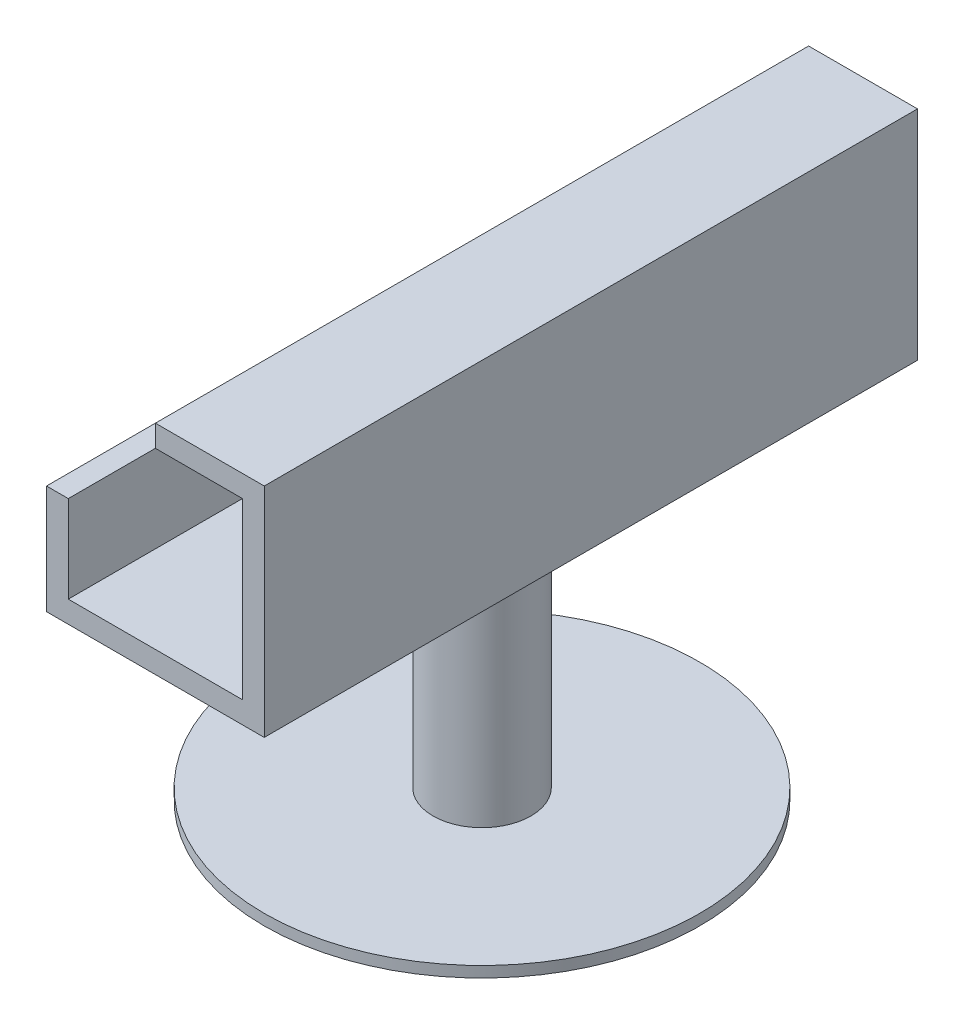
ISO-10303-21;
HEADER;
FILE_DESCRIPTION(('STEP AP214'),'2;1');
FILE_NAME('part.step','',(''),(''),'','','');
FILE_SCHEMA(('AUTOMOTIVE_DESIGN { 1 0 10303 214 1 1 1 1 }'));
ENDSEC;
DATA;
#1=APPLICATION_CONTEXT('core data for automotive mechanical design processes');
#2=APPLICATION_PROTOCOL_DEFINITION('international standard','automotive_design',2000,#1);
#3=PRODUCT_CONTEXT('',#1,'mechanical');
#4=PRODUCT('Part','Part','',(#3));
#5=PRODUCT_RELATED_PRODUCT_CATEGORY('part','',(#4));
#6=PRODUCT_DEFINITION_FORMATION('','',#4);
#7=PRODUCT_DEFINITION_CONTEXT('part definition',#1,'design');
#8=PRODUCT_DEFINITION('design','',#6,#7);
#9=PRODUCT_DEFINITION_SHAPE('','',#8);
#10=(LENGTH_UNIT() NAMED_UNIT(*) SI_UNIT(.MILLI.,.METRE.));
#11=(NAMED_UNIT(*) PLANE_ANGLE_UNIT() SI_UNIT($,.RADIAN.));
#12=(NAMED_UNIT(*) SI_UNIT($,.STERADIAN.) SOLID_ANGLE_UNIT());
#13=UNCERTAINTY_MEASURE_WITH_UNIT(LENGTH_MEASURE(1.E-05),#10,'distance_accuracy_value','');
#14=(GEOMETRIC_REPRESENTATION_CONTEXT(3) GLOBAL_UNCERTAINTY_ASSIGNED_CONTEXT((#13)) GLOBAL_UNIT_ASSIGNED_CONTEXT((#10,
#11,#12)) REPRESENTATION_CONTEXT('',''));
#15=CARTESIAN_POINT('',(0.,0.,0.));
#16=DIRECTION('',(0.,0.,1.));
#17=DIRECTION('',(1.,0.,0.));
#18=AXIS2_PLACEMENT_3D('',#15,#16,#17);
#19=CARTESIAN_POINT('',(-20.,-20.,120.));
#20=DIRECTION('',(0.,1.,0.));
#21=DIRECTION('',(0.,0.,1.));
#22=AXIS2_PLACEMENT_3D('',#19,#20,#21);
#23=PLANE('',#22);
#24=DIRECTION('',(1.,0.,0.));
#25=VECTOR('',#24,1.);
#26=CARTESIAN_POINT('',(-20.,-20.,0.));
#27=LINE('',#26,#25);
#28=CARTESIAN_POINT('',(-20.,-20.,0.));
#29=VERTEX_POINT('',#28);
#30=CARTESIAN_POINT('',(20.,-20.,0.));
#31=VERTEX_POINT('',#30);
#32=EDGE_CURVE('E161',#29,#31,#27,.T.);
#33=ORIENTED_EDGE('',*,*,#32,.T.);
#34=DIRECTION('',(0.,0.,-1.));
#35=VECTOR('',#34,1.);
#36=CARTESIAN_POINT('',(20.,-20.,120.));
#37=LINE('',#36,#35);
#38=CARTESIAN_POINT('',(20.,-20.,120.));
#39=VERTEX_POINT('',#38);
#40=EDGE_CURVE('E169',#39,#31,#37,.T.);
#41=ORIENTED_EDGE('',*,*,#40,.F.);
#42=DIRECTION('',(1.,0.,0.));
#43=VECTOR('',#42,1.);
#44=CARTESIAN_POINT('',(-20.,-20.,120.));
#45=LINE('',#44,#43);
#46=CARTESIAN_POINT('',(-20.,-20.,120.));
#47=VERTEX_POINT('',#46);
#48=EDGE_CURVE('E153',#47,#39,#45,.T.);
#49=ORIENTED_EDGE('',*,*,#48,.F.);
#50=DIRECTION('',(0.,0.,-1.));
#51=VECTOR('',#50,1.);
#52=CARTESIAN_POINT('',(-20.,-20.,120.));
#53=LINE('',#52,#51);
#54=EDGE_CURVE('E172',#47,#29,#53,.T.);
#55=ORIENTED_EDGE('',*,*,#54,.T.);
#56=EDGE_LOOP('',(#33,#41,#49,#55));
#57=FACE_BOUND('',#56,.T.);
#58=CARTESIAN_POINT('',(0.,-20.,60.));
#59=DIRECTION('',(0.,1.,0.));
#60=DIRECTION('',(0.,0.,1.));
#61=AXIS2_PLACEMENT_3D('',#58,#59,#60);
#62=CIRCLE('',#61,9.);
#63=CARTESIAN_POINT('',(0.,-20.,69.));
#64=VERTEX_POINT('',#63);
#65=EDGE_CURVE('E113',#64,#64,#62,.F.);
#66=ORIENTED_EDGE('',*,*,#65,.F.);
#67=EDGE_LOOP('',(#66));
#68=FACE_BOUND('',#67,.T.);
#69=ADVANCED_FACE('F32',(#57,#68),#23,.F.);
#70=CARTESIAN_POINT('',(-20.,-20.,120.));
#71=DIRECTION('',(0.,0.,1.));
#72=DIRECTION('',(1.,0.,0.));
#73=AXIS2_PLACEMENT_3D('',#70,#71,#72);
#74=PLANE('',#73);
#75=DIRECTION('',(0.,1.,0.));
#76=VECTOR('',#75,1.);
#77=CARTESIAN_POINT('',(0.,0.,120.));
#78=LINE('',#77,#76);
#79=CARTESIAN_POINT('',(0.,16.,120.));
#80=VERTEX_POINT('',#79);
#81=CARTESIAN_POINT('',(0.,20.,120.));
#82=VERTEX_POINT('',#81);
#83=EDGE_CURVE('E107',#80,#82,#78,.T.);
#84=ORIENTED_EDGE('',*,*,#83,.F.);
#85=DIRECTION('',(-1.,0.,0.));
#86=VECTOR('',#85,1.);
#87=CARTESIAN_POINT('',(-16.,16.,120.));
#88=LINE('',#87,#86);
#89=CARTESIAN_POINT('',(16.,16.,120.));
#90=VERTEX_POINT('',#89);
#91=EDGE_CURVE('E119',#90,#80,#88,.T.);
#92=ORIENTED_EDGE('',*,*,#91,.F.);
#93=DIRECTION('',(0.,1.,0.));
#94=VECTOR('',#93,1.);
#95=CARTESIAN_POINT('',(16.,16.,120.));
#96=LINE('',#95,#94);
#97=CARTESIAN_POINT('',(16.,-16.,120.));
#98=VERTEX_POINT('',#97);
#99=EDGE_CURVE('E126',#98,#90,#96,.T.);
#100=ORIENTED_EDGE('',*,*,#99,.F.);
#101=DIRECTION('',(1.,0.,0.));
#102=VECTOR('',#101,1.);
#103=CARTESIAN_POINT('',(-16.,-16.,120.));
#104=LINE('',#103,#102);
#105=CARTESIAN_POINT('',(-16.,-16.,120.));
#106=VERTEX_POINT('',#105);
#107=EDGE_CURVE('E130',#106,#98,#104,.T.);
#108=ORIENTED_EDGE('',*,*,#107,.F.);
#109=DIRECTION('',(0.,-1.,0.));
#110=VECTOR('',#109,1.);
#111=CARTESIAN_POINT('',(-16.,16.,120.));
#112=LINE('',#111,#110);
#113=CARTESIAN_POINT('',(-16.,0.,120.));
#114=VERTEX_POINT('',#113);
#115=EDGE_CURVE('E144',#114,#106,#112,.T.);
#116=ORIENTED_EDGE('',*,*,#115,.F.);
#117=DIRECTION('',(1.,0.,0.));
#118=VECTOR('',#117,1.);
#119=CARTESIAN_POINT('',(0.,0.,120.));
#120=LINE('',#119,#118);
#121=CARTESIAN_POINT('',(-20.,0.,120.));
#122=VERTEX_POINT('',#121);
#123=EDGE_CURVE('E46',#122,#114,#120,.T.);
#124=ORIENTED_EDGE('',*,*,#123,.F.);
#125=DIRECTION('',(0.,-1.,0.));
#126=VECTOR('',#125,1.);
#127=CARTESIAN_POINT('',(-20.,20.,120.));
#128=LINE('',#127,#126);
#129=EDGE_CURVE('E151',#122,#47,#128,.T.);
#130=ORIENTED_EDGE('',*,*,#129,.T.);
#131=ORIENTED_EDGE('',*,*,#48,.T.);
#132=DIRECTION('',(0.,1.,0.));
#133=VECTOR('',#132,1.);
#134=CARTESIAN_POINT('',(20.,20.,120.));
#135=LINE('',#134,#133);
#136=CARTESIAN_POINT('',(20.,20.,120.));
#137=VERTEX_POINT('',#136);
#138=EDGE_CURVE('E156',#39,#137,#135,.T.);
#139=ORIENTED_EDGE('',*,*,#138,.T.);
#140=DIRECTION('',(-1.,0.,0.));
#141=VECTOR('',#140,1.);
#142=CARTESIAN_POINT('',(-20.,20.,120.));
#143=LINE('',#142,#141);
#144=EDGE_CURVE('E121',#137,#82,#143,.T.);
#145=ORIENTED_EDGE('',*,*,#144,.T.);
#146=EDGE_LOOP('',(#84,#92,#100,#108,#116,#124,#130,#131,#139,#145));
#147=FACE_BOUND('',#146,.T.);
#148=ADVANCED_FACE('F117',(#147),#74,.T.);
#149=CARTESIAN_POINT('',(-20.,-20.,0.));
#150=DIRECTION('',(0.,0.,1.));
#151=DIRECTION('',(1.,0.,0.));
#152=AXIS2_PLACEMENT_3D('',#149,#150,#151);
#153=PLANE('',#152);
#154=DIRECTION('',(-1.,0.,0.));
#155=VECTOR('',#154,1.);
#156=CARTESIAN_POINT('',(-16.,16.,0.));
#157=LINE('',#156,#155);
#158=CARTESIAN_POINT('',(16.,16.,0.));
#159=VERTEX_POINT('',#158);
#160=CARTESIAN_POINT('',(0.,16.,0.));
#161=VERTEX_POINT('',#160);
#162=EDGE_CURVE('E143',#159,#161,#157,.T.);
#163=ORIENTED_EDGE('',*,*,#162,.T.);
#164=DIRECTION('',(0.,1.,0.));
#165=VECTOR('',#164,1.);
#166=CARTESIAN_POINT('',(0.,0.,0.));
#167=LINE('',#166,#165);
#168=CARTESIAN_POINT('',(0.,20.,0.));
#169=VERTEX_POINT('',#168);
#170=EDGE_CURVE('E54',#161,#169,#167,.T.);
#171=ORIENTED_EDGE('',*,*,#170,.T.);
#172=DIRECTION('',(-1.,0.,0.));
#173=VECTOR('',#172,1.);
#174=CARTESIAN_POINT('',(-20.,20.,0.));
#175=LINE('',#174,#173);
#176=CARTESIAN_POINT('',(20.,20.,0.));
#177=VERTEX_POINT('',#176);
#178=EDGE_CURVE('E154',#177,#169,#175,.T.);
#179=ORIENTED_EDGE('',*,*,#178,.F.);
#180=DIRECTION('',(0.,1.,0.));
#181=VECTOR('',#180,1.);
#182=CARTESIAN_POINT('',(20.,20.,0.));
#183=LINE('',#182,#181);
#184=EDGE_CURVE('E163',#31,#177,#183,.T.);
#185=ORIENTED_EDGE('',*,*,#184,.F.);
#186=ORIENTED_EDGE('',*,*,#32,.F.);
#187=DIRECTION('',(0.,-1.,0.));
#188=VECTOR('',#187,1.);
#189=CARTESIAN_POINT('',(-20.,20.,0.));
#190=LINE('',#189,#188);
#191=CARTESIAN_POINT('',(-20.,0.,0.));
#192=VERTEX_POINT('',#191);
#193=EDGE_CURVE('E150',#192,#29,#190,.T.);
#194=ORIENTED_EDGE('',*,*,#193,.F.);
#195=DIRECTION('',(1.,0.,0.));
#196=VECTOR('',#195,1.);
#197=CARTESIAN_POINT('',(0.,0.,0.));
#198=LINE('',#197,#196);
#199=CARTESIAN_POINT('',(-16.,0.,0.));
#200=VERTEX_POINT('',#199);
#201=EDGE_CURVE('E342',#192,#200,#198,.T.);
#202=ORIENTED_EDGE('',*,*,#201,.T.);
#203=DIRECTION('',(0.,-1.,0.));
#204=VECTOR('',#203,1.);
#205=CARTESIAN_POINT('',(-16.,16.,0.));
#206=LINE('',#205,#204);
#207=CARTESIAN_POINT('',(-16.,-16.,0.));
#208=VERTEX_POINT('',#207);
#209=EDGE_CURVE('E134',#200,#208,#206,.T.);
#210=ORIENTED_EDGE('',*,*,#209,.T.);
#211=DIRECTION('',(1.,0.,0.));
#212=VECTOR('',#211,1.);
#213=CARTESIAN_POINT('',(-16.,-16.,0.));
#214=LINE('',#213,#212);
#215=CARTESIAN_POINT('',(16.,-16.,0.));
#216=VERTEX_POINT('',#215);
#217=EDGE_CURVE('E136',#208,#216,#214,.T.);
#218=ORIENTED_EDGE('',*,*,#217,.T.);
#219=DIRECTION('',(0.,1.,0.));
#220=VECTOR('',#219,1.);
#221=CARTESIAN_POINT('',(16.,16.,0.));
#222=LINE('',#221,#220);
#223=EDGE_CURVE('E140',#216,#159,#222,.T.);
#224=ORIENTED_EDGE('',*,*,#223,.T.);
#225=EDGE_LOOP('',(#163,#171,#179,#185,#186,#194,#202,#210,#218,#224));
#226=FACE_BOUND('',#225,.T.);
#227=ADVANCED_FACE('F185',(#226),#153,.F.);
#228=CARTESIAN_POINT('',(-20.,20.,120.));
#229=DIRECTION('',(1.,0.,0.));
#230=DIRECTION('',(0.,0.,-1.));
#231=AXIS2_PLACEMENT_3D('',#228,#229,#230);
#232=PLANE('',#231);
#233=ORIENTED_EDGE('',*,*,#129,.F.);
#234=DIRECTION('',(0.,0.,-1.));
#235=VECTOR('',#234,1.);
#236=CARTESIAN_POINT('',(-20.,0.,120.));
#237=LINE('',#236,#235);
#238=EDGE_CURVE('E331',#122,#192,#237,.T.);
#239=ORIENTED_EDGE('',*,*,#238,.T.);
#240=ORIENTED_EDGE('',*,*,#193,.T.);
#241=ORIENTED_EDGE('',*,*,#54,.F.);
#242=EDGE_LOOP('',(#233,#239,#240,#241));
#243=FACE_BOUND('',#242,.T.);
#244=ADVANCED_FACE('F34',(#243),#232,.F.);
#245=CARTESIAN_POINT('',(20.,20.,120.));
#246=DIRECTION('',(-1.,0.,0.));
#247=DIRECTION('',(0.,0.,1.));
#248=AXIS2_PLACEMENT_3D('',#245,#246,#247);
#249=PLANE('',#248);
#250=ORIENTED_EDGE('',*,*,#184,.T.);
#251=DIRECTION('',(0.,0.,-1.));
#252=VECTOR('',#251,1.);
#253=CARTESIAN_POINT('',(20.,20.,120.));
#254=LINE('',#253,#252);
#255=EDGE_CURVE('E159',#137,#177,#254,.T.);
#256=ORIENTED_EDGE('',*,*,#255,.F.);
#257=ORIENTED_EDGE('',*,*,#138,.F.);
#258=ORIENTED_EDGE('',*,*,#40,.T.);
#259=EDGE_LOOP('',(#250,#256,#257,#258));
#260=FACE_BOUND('',#259,.T.);
#261=ADVANCED_FACE('F188',(#260),#249,.F.);
#262=CARTESIAN_POINT('',(-20.,20.,120.));
#263=DIRECTION('',(0.,-1.,0.));
#264=DIRECTION('',(0.,0.,-1.));
#265=AXIS2_PLACEMENT_3D('',#262,#263,#264);
#266=PLANE('',#265);
#267=ORIENTED_EDGE('',*,*,#178,.T.);
#268=DIRECTION('',(0.,0.,1.));
#269=VECTOR('',#268,1.);
#270=CARTESIAN_POINT('',(0.,20.,120.));
#271=LINE('',#270,#269);
#272=EDGE_CURVE('E341',#169,#82,#271,.T.);
#273=ORIENTED_EDGE('',*,*,#272,.T.);
#274=ORIENTED_EDGE('',*,*,#144,.F.);
#275=ORIENTED_EDGE('',*,*,#255,.T.);
#276=EDGE_LOOP('',(#267,#273,#274,#275));
#277=FACE_BOUND('',#276,.T.);
#278=ADVANCED_FACE('F191',(#277),#266,.F.);
#279=CARTESIAN_POINT('',(-16.,16.,120.));
#280=DIRECTION('',(1.,0.,0.));
#281=DIRECTION('',(0.,0.,-1.));
#282=AXIS2_PLACEMENT_3D('',#279,#280,#281);
#283=PLANE('',#282);
#284=DIRECTION('',(0.,0.,-1.));
#285=VECTOR('',#284,1.);
#286=CARTESIAN_POINT('',(-16.,0.,120.));
#287=LINE('',#286,#285);
#288=EDGE_CURVE('E11',#114,#200,#287,.T.);
#289=ORIENTED_EDGE('',*,*,#288,.F.);
#290=ORIENTED_EDGE('',*,*,#115,.T.);
#291=DIRECTION('',(0.,0.,-1.));
#292=VECTOR('',#291,1.);
#293=CARTESIAN_POINT('',(-16.,-16.,120.));
#294=LINE('',#293,#292);
#295=EDGE_CURVE('E147',#106,#208,#294,.T.);
#296=ORIENTED_EDGE('',*,*,#295,.T.);
#297=ORIENTED_EDGE('',*,*,#209,.F.);
#298=EDGE_LOOP('',(#289,#290,#296,#297));
#299=FACE_BOUND('',#298,.T.);
#300=ADVANCED_FACE('F195',(#299),#283,.T.);
#301=CARTESIAN_POINT('',(-16.,-16.,120.));
#302=DIRECTION('',(0.,1.,0.));
#303=DIRECTION('',(0.,0.,1.));
#304=AXIS2_PLACEMENT_3D('',#301,#302,#303);
#305=PLANE('',#304);
#306=ORIENTED_EDGE('',*,*,#217,.F.);
#307=ORIENTED_EDGE('',*,*,#295,.F.);
#308=ORIENTED_EDGE('',*,*,#107,.T.);
#309=DIRECTION('',(0.,0.,-1.));
#310=VECTOR('',#309,1.);
#311=CARTESIAN_POINT('',(16.,-16.,120.));
#312=LINE('',#311,#310);
#313=EDGE_CURVE('E128',#98,#216,#312,.T.);
#314=ORIENTED_EDGE('',*,*,#313,.T.);
#315=EDGE_LOOP('',(#306,#307,#308,#314));
#316=FACE_BOUND('',#315,.T.);
#317=ADVANCED_FACE('F202',(#316),#305,.T.);
#318=CARTESIAN_POINT('',(16.,16.,120.));
#319=DIRECTION('',(-1.,0.,0.));
#320=DIRECTION('',(0.,0.,1.));
#321=AXIS2_PLACEMENT_3D('',#318,#319,#320);
#322=PLANE('',#321);
#323=ORIENTED_EDGE('',*,*,#223,.F.);
#324=ORIENTED_EDGE('',*,*,#313,.F.);
#325=ORIENTED_EDGE('',*,*,#99,.T.);
#326=DIRECTION('',(0.,0.,-1.));
#327=VECTOR('',#326,1.);
#328=CARTESIAN_POINT('',(16.,16.,120.));
#329=LINE('',#328,#327);
#330=EDGE_CURVE('E124',#90,#159,#329,.T.);
#331=ORIENTED_EDGE('',*,*,#330,.T.);
#332=EDGE_LOOP('',(#323,#324,#325,#331));
#333=FACE_BOUND('',#332,.T.);
#334=ADVANCED_FACE('F206',(#333),#322,.T.);
#335=CARTESIAN_POINT('',(-16.,16.,120.));
#336=DIRECTION('',(0.,-1.,0.));
#337=DIRECTION('',(0.,0.,-1.));
#338=AXIS2_PLACEMENT_3D('',#335,#336,#337);
#339=PLANE('',#338);
#340=DIRECTION('',(0.,0.,1.));
#341=VECTOR('',#340,1.);
#342=CARTESIAN_POINT('',(0.,16.,120.));
#343=LINE('',#342,#341);
#344=EDGE_CURVE('E40',#161,#80,#343,.T.);
#345=ORIENTED_EDGE('',*,*,#344,.F.);
#346=ORIENTED_EDGE('',*,*,#162,.F.);
#347=ORIENTED_EDGE('',*,*,#330,.F.);
#348=ORIENTED_EDGE('',*,*,#91,.T.);
#349=EDGE_LOOP('',(#345,#346,#347,#348));
#350=FACE_BOUND('',#349,.T.);
#351=ADVANCED_FACE('F123',(#350),#339,.T.);
#352=CARTESIAN_POINT('',(0.,5.45584412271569,60.));
#353=DIRECTION('',(0.,-1.,0.));
#354=DIRECTION('',(0.,0.,-1.));
#355=AXIS2_PLACEMENT_3D('',#352,#353,#354);
#356=CYLINDRICAL_SURFACE('',#355,9.);
#357=CARTESIAN_POINT('',(0.,-68.,60.));
#358=DIRECTION('',(0.,1.,0.));
#359=DIRECTION('',(0.,0.,1.));
#360=AXIS2_PLACEMENT_3D('',#357,#358,#359);
#361=CIRCLE('',#360,9.);
#362=CARTESIAN_POINT('',(0.,-68.,69.));
#363=VERTEX_POINT('',#362);
#364=EDGE_CURVE('E137',#363,#363,#361,.T.);
#365=ORIENTED_EDGE('',*,*,#364,.T.);
#366=EDGE_LOOP('',(#365));
#367=FACE_BOUND('',#366,.T.);
#368=ORIENTED_EDGE('',*,*,#65,.T.);
#369=EDGE_LOOP('',(#368));
#370=FACE_BOUND('',#369,.T.);
#371=ADVANCED_FACE('F178',(#367,#370),#356,.T.);
#372=CARTESIAN_POINT('',(0.,-68.,60.));
#373=DIRECTION('',(0.,1.,0.));
#374=DIRECTION('',(0.,0.,1.));
#375=AXIS2_PLACEMENT_3D('',#372,#373,#374);
#376=PLANE('',#375);
#377=CARTESIAN_POINT('',(0.,-68.,60.));
#378=DIRECTION('',(0.,1.,0.));
#379=DIRECTION('',(0.,0.,1.));
#380=AXIS2_PLACEMENT_3D('',#377,#378,#379);
#381=CIRCLE('',#380,40.);
#382=CARTESIAN_POINT('',(0.,-68.,100.));
#383=VERTEX_POINT('',#382);
#384=EDGE_CURVE('E350',#383,#383,#381,.T.);
#385=ORIENTED_EDGE('',*,*,#384,.T.);
#386=EDGE_LOOP('',(#385));
#387=FACE_BOUND('',#386,.T.);
#388=ORIENTED_EDGE('',*,*,#364,.F.);
#389=EDGE_LOOP('',(#388));
#390=FACE_BOUND('',#389,.T.);
#391=ADVANCED_FACE('F215',(#387,#390),#376,.T.);
#392=CARTESIAN_POINT('',(0.,-68.,60.));
#393=DIRECTION('',(0.,-1.,0.));
#394=DIRECTION('',(0.,0.,-1.));
#395=AXIS2_PLACEMENT_3D('',#392,#393,#394);
#396=CYLINDRICAL_SURFACE('',#395,40.);
#397=ORIENTED_EDGE('',*,*,#384,.F.);
#398=EDGE_LOOP('',(#397));
#399=FACE_BOUND('',#398,.T.);
#400=CARTESIAN_POINT('',(0.,-70.,60.));
#401=DIRECTION('',(0.,1.,0.));
#402=DIRECTION('',(0.,0.,1.));
#403=AXIS2_PLACEMENT_3D('',#400,#401,#402);
#404=CIRCLE('',#403,40.);
#405=CARTESIAN_POINT('',(0.,-70.,100.));
#406=VERTEX_POINT('',#405);
#407=EDGE_CURVE('E344',#406,#406,#404,.T.);
#408=ORIENTED_EDGE('',*,*,#407,.T.);
#409=EDGE_LOOP('',(#408));
#410=FACE_BOUND('',#409,.T.);
#411=ADVANCED_FACE('F217',(#399,#410),#396,.T.);
#412=CARTESIAN_POINT('',(0.,-70.,60.));
#413=DIRECTION('',(0.,1.,0.));
#414=DIRECTION('',(0.,0.,1.));
#415=AXIS2_PLACEMENT_3D('',#412,#413,#414);
#416=PLANE('',#415);
#417=ORIENTED_EDGE('',*,*,#407,.F.);
#418=EDGE_LOOP('',(#417));
#419=FACE_BOUND('',#418,.T.);
#420=ADVANCED_FACE('F220',(#419),#416,.F.);
#421=CARTESIAN_POINT('',(0.,0.,0.));
#422=DIRECTION('',(1.,0.,0.));
#423=DIRECTION('',(0.,0.,-1.));
#424=AXIS2_PLACEMENT_3D('',#421,#422,#423);
#425=PLANE('',#424);
#426=ORIENTED_EDGE('',*,*,#170,.F.);
#427=ORIENTED_EDGE('',*,*,#344,.T.);
#428=ORIENTED_EDGE('',*,*,#83,.T.);
#429=ORIENTED_EDGE('',*,*,#272,.F.);
#430=EDGE_LOOP('',(#426,#427,#428,#429));
#431=FACE_BOUND('',#430,.T.);
#432=ADVANCED_FACE('F106',(#431),#425,.F.);
#433=CARTESIAN_POINT('',(0.,0.,0.));
#434=DIRECTION('',(0.,-1.,0.));
#435=DIRECTION('',(0.,0.,-1.));
#436=AXIS2_PLACEMENT_3D('',#433,#434,#435);
#437=PLANE('',#436);
#438=ORIENTED_EDGE('',*,*,#123,.T.);
#439=ORIENTED_EDGE('',*,*,#288,.T.);
#440=ORIENTED_EDGE('',*,*,#201,.F.);
#441=ORIENTED_EDGE('',*,*,#238,.F.);
#442=EDGE_LOOP('',(#438,#439,#440,#441));
#443=FACE_BOUND('',#442,.T.);
#444=ADVANCED_FACE('F230',(#443),#437,.F.);
#445=CLOSED_SHELL('',(#69,#148,#227,#244,#261,#278,#300,#317,#334,#351,#371,#391,#411,#420,#432,#444));
#446=MANIFOLD_SOLID_BREP('B2',#445);
#447=ADVANCED_BREP_SHAPE_REPRESENTATION('',(#18,#446),#14);
#448=SHAPE_DEFINITION_REPRESENTATION(#9,#447);
ENDSEC;
END-ISO-10303-21;
